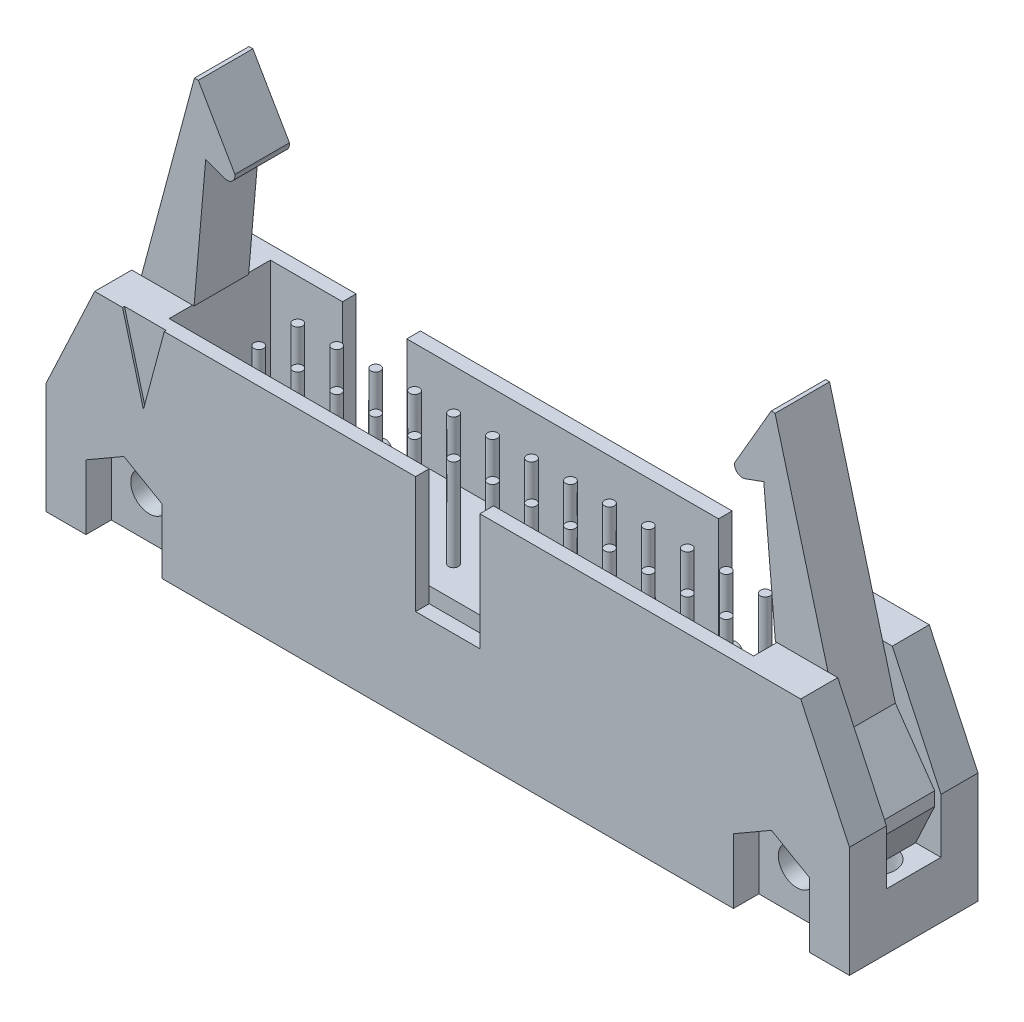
from build123d import *

# Parameters (mm, degrees)
SKETCH1_W                = 52.3748
SKETCH1_H                = 14.0208
BASE_EXTRUDE_DEPTH       = 8.382
ANGLE_CUT_OUTSIDE_DEPTH  = 55.863106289
SKETCH3_W                = 38.1
SKETCH3_H                = 6.604
INSIDE_CUT1_DEPTH        = 6.604
SKETCH4_W                = 4.191
SKETCH4_H                = 7.62
CENTER_CUT1_DEPTH        = 0.889
SKETCH5_R                = 0.3175
PIN_1_BOSS_DEPTH         = 5.969
F_26P_PATTERN_COUNT      = 13
F_26P_PATTERN_PITCH      = 2.54
F_26P_PATTERN_COUNT_DIR2 = 2
F_26P_PATTERN_PITCH_DIR2 = 2.54
SKETCH6_W                = 4.191
SKETCH6_H                = 7.62
REAR_CUT1_DEPTH          = 0.889
LATCHES_DEPTH            = 3.556
LATCH_CUT1_DEPTH         = 3.556
PIN_1_TRIANGLE_CUT_DEPTH = 0.127
SCREW_RECESS_DEPTH       = 1.651
SKETCH12_R               = 1.2065
SCREW_HOLE_DEPTH         = 60.473221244
SKETCH13_R               = 1.27
VERT_MNT_HOLE_DEPTH      = 3.683
SKETCH15_W               = 34.544
SKETCH15_H               = 4.318
R_ANG_REAR_CUT1_DEPTH    = 1.524
SKETCH14_R               = 0.4445
R_ANG_PIN1_DEPTH         = 4.318
R_ANG_PATTERN_COUNT      = 13
R_ANG_PATTERN_PITCH      = 2.54
R_ANG_PATTERN_COUNT_DIR2 = 2
R_ANG_PATTERN_PITCH_DIR2 = 2.54


with BuildPart() as part:
    # Sketch1 → Base-Extrude (new body)
    with BuildSketch(Plane.XY):
        with Locations((26.1874, 7.0104)):
            Rectangle(SKETCH1_W, SKETCH1_H)
    extrude(amount=-BASE_EXTRUDE_DEPTH)

    # Sketch2 → Angle Cut Outside (cut, through all)
    with BuildSketch(Plane.XY):
        Polygon((3.175, 14.0208), (0, 7.239), (0, 14.0208), align=None)
        Polygon((52.3748, 14.0208), (49.1998, 14.0208), (52.3748, 7.239), align=None)
    extrude(amount=-ANGLE_CUT_OUTSIDE_DEPTH, mode=Mode.SUBTRACT)

    # Sketch3 → Inside Cut1 (cut)
    with BuildSketch(Plane(origin=(0, 14.0208, 0), x_dir=(-1, 0, 0), z_dir=(0, 1, 0))):
        with Locations((-26.1874, -4.191)):
            Rectangle(SKETCH3_W, SKETCH3_H)
    extrude(amount=-INSIDE_CUT1_DEPTH, mode=Mode.SUBTRACT)

    # Sketch4 → Center Cut1 (cut)
    with BuildSketch(Plane.XY):
        with Locations((26.1874, 10.2108)):
            Rectangle(SKETCH4_W, SKETCH4_H)
    extrude(amount=-CENTER_CUT1_DEPTH, mode=Mode.SUBTRACT)

    # Sketch5 → Pin 1 Boss (add)
    with BuildSketch(Plane(origin=(0, 7.4168, 0), x_dir=(-1, 0, 0), z_dir=(0, 1, 0))):
        with Locations(Location((-10.9474, -2.921, 0), (0, 0, 270))):
            Circle(SKETCH5_R)
    pin_1_boss = extrude(amount=PIN_1_BOSS_DEPTH)

    # 26p Pattern: Pin 1 Boss 13 × 2
    with Locations(*[(i * F_26P_PATTERN_PITCH, 0, -j * F_26P_PATTERN_PITCH_DIR2) for i in range(F_26P_PATTERN_COUNT) for j in range(F_26P_PATTERN_COUNT_DIR2) if (i, j) != (0, 0)]):
        add(pin_1_boss)

    # Sketch6 → Rear Cut1 (cut)
    with BuildSketch(Plane(origin=(0, 0, -8.382), x_dir=(-1, 0, 0), z_dir=(0, 0, -1))):
        with Locations((-38.4429, 10.2108)):
            Rectangle(SKETCH6_W, SKETCH6_H)
        with Locations((-13.9319, 10.2108)):
            Rectangle(SKETCH6_W, SKETCH6_H)
    extrude(amount=-REAR_CUT1_DEPTH, mode=Mode.SUBTRACT)

    # Sketch7 → Latches (add)
    with BuildSketch(Plane.XY.offset(-2.413)):
        with BuildLine():
            Line((44.379073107, 22.67022796), (45.1358, 14.0208))
            Line((45.1358, 14.0208), (48.5648, 14.0208))
            Line((48.5648, 14.0208), (45.113448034, 26.901420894))
            Line((45.113448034, 26.901420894), (44.859448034, 26.901420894))
            Line((44.859448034, 26.901420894), (42.474073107, 22.787768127))
            Line((42.474073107, 22.787768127), (42.474073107, 22.702363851))
            ThreePointArc((42.474073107, 22.702363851), (42.690696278, 22.286234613), (43.15581934, 22.225))
            Line((43.15581934, 22.225), (44.379073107, 22.67022796))
        make_face()
        with BuildLine():
            Line((7.239, 14.0208), (3.81, 14.0208))
            Line((3.81, 14.0208), (7.261351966, 26.901420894))
            Line((7.261351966, 26.901420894), (7.515351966, 26.901420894))
            Line((7.515351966, 26.901420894), (9.900726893, 22.787768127))
            Line((9.900726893, 22.787768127), (9.900726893, 22.702363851))
            ThreePointArc((9.900726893, 22.702363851), (9.684103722, 22.286234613), (9.21898066, 22.225))
            Line((9.21898066, 22.225), (7.995726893, 22.67022796))
            Line((7.995726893, 22.67022796), (7.239, 14.0208))
        make_face()
    extrude(amount=-LATCHES_DEPTH)

    # Sketch8 → Latch Cut1 (cut)
    with BuildSketch(Plane.XY.offset(-2.413)):
        Polygon((3.81, 14.0208), (2.974670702, 10.903308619), (0.408894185, 7.239), (0.408894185, 6.35), (1.652536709, 3.683), (0, 3.683), (0, 7.239), (3.175, 14.0208), align=None)
        Polygon((48.5648, 14.0208), (49.1998, 14.0208), (52.3748, 7.239), (52.3748, 3.683), (50.722263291, 3.683), (51.965905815, 6.35), (51.965905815, 7.239), (49.400129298, 10.903308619), align=None)
    extrude(amount=-LATCH_CUT1_DEPTH, mode=Mode.SUBTRACT)

    # Sketch9 → Pin 1 Triangle Cut (cut)
    with BuildSketch(Plane.XY):
        Polygon((4.988818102, 14.0208), (6.35, 8.9408), (7.711181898, 14.0208), align=None)
    extrude(amount=-PIN_1_TRIANGLE_CUT_DEPTH, mode=Mode.SUBTRACT)

    # Sketch10 → Screw Recess (cut)
    with BuildSketch(Plane.XY):
        Polygon((7.5565, 0), (7.5565, 4.223807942), (5.08, 5.653615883), (2.6035, 4.223807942), (2.6035, 0), align=None)
        Polygon((49.7713, 0), (44.8183, 0), (44.8183, 4.223807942), (47.2948, 5.653615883), (49.7713, 4.223807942), align=None)
    extrude(amount=-SCREW_RECESS_DEPTH, mode=Mode.SUBTRACT)

    # Sketch12 → Screw Hole (cut, through all)
    with BuildSketch(Plane.XY):
        with Locations((5.08, 2.794)):
            Circle(SKETCH12_R)
        with Locations(Location((47.2948, 2.794, 0), (0, 0, 180))):
            Circle(SKETCH12_R)
    extrude(amount=-SCREW_HOLE_DEPTH, mode=Mode.SUBTRACT)

    # Sketch13 → Vert Mnt Hole (cut)
    with BuildSketch(Plane.XZ):
        with Locations(Location((2.032, -3.7338, 0), (0, 0, 270))):
            Circle(SKETCH13_R)
        with Locations(Location((50.3428, -3.7338, 0), (0, 0, 287.384941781))):
            Circle(SKETCH13_R)
    extrude(amount=-VERT_MNT_HOLE_DEPTH, mode=Mode.SUBTRACT)

    # Sketch15 → R Ang Rear Cut1 (cut)
    with BuildSketch(Plane(origin=(0, 0, -8.382), x_dir=(-1, 0, 0), z_dir=(0, 0, -1))):
        with Locations((-26.1874, 2.159)):
            Rectangle(SKETCH15_W, SKETCH15_H)
    extrude(amount=-R_ANG_REAR_CUT1_DEPTH, mode=Mode.SUBTRACT)

    # Sketch14 → R Ang Pin1 (add)
    with BuildSketch(Plane(origin=(0, 0, -6.858), x_dir=(-1, 0, 0), z_dir=(0, 0, -1))):
        with Locations((-10.9474, 0.9906)):
            Circle(SKETCH14_R)
    r_ang_pin1 = extrude(amount=R_ANG_PIN1_DEPTH)

    # R Ang Pattern: R Ang Pin1 13 × 2
    with Locations(*[(i * R_ANG_PATTERN_PITCH, j * R_ANG_PATTERN_PITCH_DIR2, 0) for i in range(R_ANG_PATTERN_COUNT) for j in range(R_ANG_PATTERN_COUNT_DIR2) if (i, j) != (0, 0)]):
        add(r_ang_pin1)


solid = part.part
